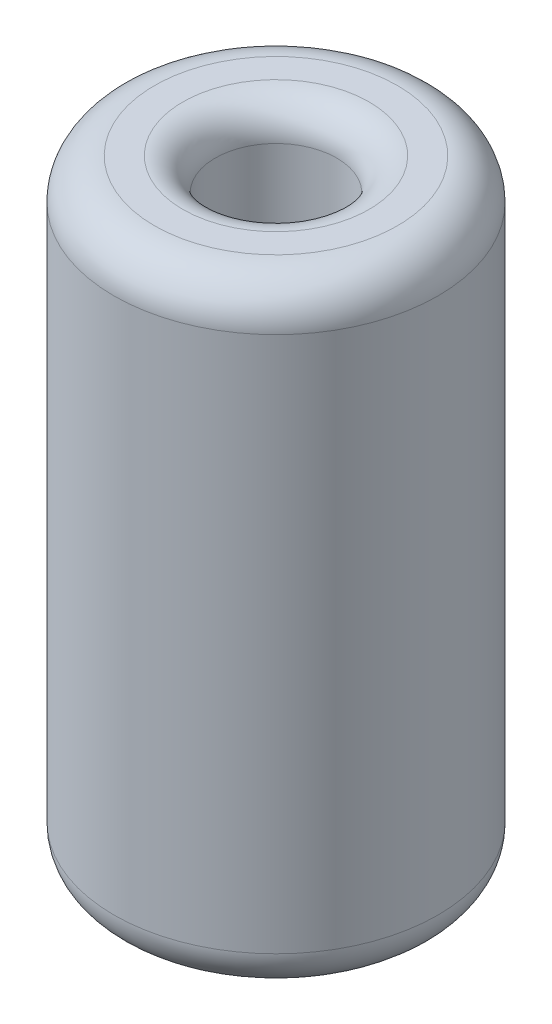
ISO-10303-21;
HEADER;
FILE_DESCRIPTION(('STEP AP214'),'2;1');
FILE_NAME('part.step','',(''),(''),'','','');
FILE_SCHEMA(('AUTOMOTIVE_DESIGN { 1 0 10303 214 1 1 1 1 }'));
ENDSEC;
DATA;
#1=APPLICATION_CONTEXT('core data for automotive mechanical design processes');
#2=APPLICATION_PROTOCOL_DEFINITION('international standard','automotive_design',2000,#1);
#3=PRODUCT_CONTEXT('',#1,'mechanical');
#4=PRODUCT('Part','Part','',(#3));
#5=PRODUCT_RELATED_PRODUCT_CATEGORY('part','',(#4));
#6=PRODUCT_DEFINITION_FORMATION('','',#4);
#7=PRODUCT_DEFINITION_CONTEXT('part definition',#1,'design');
#8=PRODUCT_DEFINITION('design','',#6,#7);
#9=PRODUCT_DEFINITION_SHAPE('','',#8);
#10=(LENGTH_UNIT() NAMED_UNIT(*) SI_UNIT(.MILLI.,.METRE.));
#11=(NAMED_UNIT(*) PLANE_ANGLE_UNIT() SI_UNIT($,.RADIAN.));
#12=(NAMED_UNIT(*) SI_UNIT($,.STERADIAN.) SOLID_ANGLE_UNIT());
#13=UNCERTAINTY_MEASURE_WITH_UNIT(LENGTH_MEASURE(1.E-05),#10,'distance_accuracy_value','');
#14=(GEOMETRIC_REPRESENTATION_CONTEXT(3) GLOBAL_UNCERTAINTY_ASSIGNED_CONTEXT((#13)) GLOBAL_UNIT_ASSIGNED_CONTEXT((#10,
#11,#12)) REPRESENTATION_CONTEXT('',''));
#15=CARTESIAN_POINT('',(0.,0.,0.));
#16=DIRECTION('',(0.,0.,1.));
#17=DIRECTION('',(1.,0.,0.));
#18=AXIS2_PLACEMENT_3D('',#15,#16,#17);
#19=CARTESIAN_POINT('',(0.,0.5,0.));
#20=DIRECTION('',(0.,-1.,0.));
#21=DIRECTION('',(0.,0.,-1.));
#22=AXIS2_PLACEMENT_3D('',#19,#20,#21);
#23=TOROIDAL_SURFACE('',#22,1.5,0.5);
#24=CARTESIAN_POINT('',(0.,0.500000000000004,0.));
#25=DIRECTION('',(0.,-1.,0.));
#26=DIRECTION('',(0.,0.,-1.));
#27=AXIS2_PLACEMENT_3D('',#24,#25,#26);
#28=CIRCLE('',#27,2.);
#29=CARTESIAN_POINT('',(0.,0.500000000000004,-2.));
#30=VERTEX_POINT('',#29);
#31=EDGE_CURVE('E10',#30,#30,#28,.T.);
#32=ORIENTED_EDGE('',*,*,#31,.T.);
#33=EDGE_LOOP('',(#32));
#34=FACE_BOUND('',#33,.T.);
#35=CARTESIAN_POINT('',(0.,0.,0.));
#36=DIRECTION('',(0.,-1.,0.));
#37=DIRECTION('',(0.,0.,-1.));
#38=AXIS2_PLACEMENT_3D('',#35,#36,#37);
#39=CIRCLE('',#38,1.5);
#40=CARTESIAN_POINT('',(0.,0.,-1.5));
#41=VERTEX_POINT('',#40);
#42=EDGE_CURVE('E63',#41,#41,#39,.T.);
#43=ORIENTED_EDGE('',*,*,#42,.F.);
#44=EDGE_LOOP('',(#43));
#45=FACE_BOUND('',#44,.T.);
#46=ADVANCED_FACE('F35',(#34,#45),#23,.T.);
#47=CARTESIAN_POINT('',(0.,0.,0.));
#48=DIRECTION('',(0.,-1.,0.));
#49=DIRECTION('',(0.,0.,-1.));
#50=AXIS2_PLACEMENT_3D('',#47,#48,#49);
#51=CYLINDRICAL_SURFACE('',#50,2.);
#52=CARTESIAN_POINT('',(0.,7.12,0.));
#53=DIRECTION('',(0.,-1.,0.));
#54=DIRECTION('',(0.,0.,-1.));
#55=AXIS2_PLACEMENT_3D('',#52,#53,#54);
#56=CIRCLE('',#55,2.);
#57=CARTESIAN_POINT('',(0.,7.12,-2.));
#58=VERTEX_POINT('',#57);
#59=EDGE_CURVE('E41',#58,#58,#56,.T.);
#60=ORIENTED_EDGE('',*,*,#59,.T.);
#61=EDGE_LOOP('',(#60));
#62=FACE_BOUND('',#61,.T.);
#63=ORIENTED_EDGE('',*,*,#31,.F.);
#64=EDGE_LOOP('',(#63));
#65=FACE_BOUND('',#64,.T.);
#66=ADVANCED_FACE('F71',(#62,#65),#51,.T.);
#67=CARTESIAN_POINT('',(0.,7.12,0.));
#68=DIRECTION('',(0.,-1.,0.));
#69=DIRECTION('',(0.,0.,-1.));
#70=AXIS2_PLACEMENT_3D('',#67,#68,#69);
#71=TOROIDAL_SURFACE('',#70,1.5,0.5);
#72=CARTESIAN_POINT('',(0.,7.62,0.));
#73=DIRECTION('',(0.,-1.,0.));
#74=DIRECTION('',(0.,0.,-1.));
#75=AXIS2_PLACEMENT_3D('',#72,#73,#74);
#76=CIRCLE('',#75,1.5);
#77=CARTESIAN_POINT('',(0.,7.62,-1.5));
#78=VERTEX_POINT('',#77);
#79=EDGE_CURVE('E45',#78,#78,#76,.T.);
#80=ORIENTED_EDGE('',*,*,#79,.T.);
#81=EDGE_LOOP('',(#80));
#82=FACE_BOUND('',#81,.T.);
#83=ORIENTED_EDGE('',*,*,#59,.F.);
#84=EDGE_LOOP('',(#83));
#85=FACE_BOUND('',#84,.T.);
#86=ADVANCED_FACE('F75',(#82,#85),#71,.T.);
#87=CARTESIAN_POINT('',(1.5,7.62,0.));
#88=DIRECTION('',(0.,1.,0.));
#89=DIRECTION('',(0.,0.,1.));
#90=AXIS2_PLACEMENT_3D('',#87,#88,#89);
#91=PLANE('',#90);
#92=CARTESIAN_POINT('',(0.,7.62,0.));
#93=DIRECTION('',(0.,-1.,0.));
#94=DIRECTION('',(0.,0.,-1.));
#95=AXIS2_PLACEMENT_3D('',#92,#93,#94);
#96=CIRCLE('',#95,1.15);
#97=CARTESIAN_POINT('',(0.,7.62,-1.15));
#98=VERTEX_POINT('',#97);
#99=EDGE_CURVE('E49',#98,#98,#96,.T.);
#100=ORIENTED_EDGE('',*,*,#99,.T.);
#101=EDGE_LOOP('',(#100));
#102=FACE_BOUND('',#101,.T.);
#103=ORIENTED_EDGE('',*,*,#79,.F.);
#104=EDGE_LOOP('',(#103));
#105=FACE_BOUND('',#104,.T.);
#106=ADVANCED_FACE('F79',(#102,#105),#91,.T.);
#107=CARTESIAN_POINT('',(0.,7.22,0.));
#108=DIRECTION('',(0.,-1.,0.));
#109=DIRECTION('',(0.,0.,-1.));
#110=AXIS2_PLACEMENT_3D('',#107,#108,#109);
#111=TOROIDAL_SURFACE('',#110,1.15,0.4);
#112=CARTESIAN_POINT('',(0.,7.22,0.));
#113=DIRECTION('',(0.,-1.,0.));
#114=DIRECTION('',(0.,0.,-1.));
#115=AXIS2_PLACEMENT_3D('',#112,#113,#114);
#116=CIRCLE('',#115,0.75);
#117=CARTESIAN_POINT('',(0.,7.22,-0.75));
#118=VERTEX_POINT('',#117);
#119=EDGE_CURVE('E54',#118,#118,#116,.T.);
#120=ORIENTED_EDGE('',*,*,#119,.T.);
#121=EDGE_LOOP('',(#120));
#122=FACE_BOUND('',#121,.T.);
#123=ORIENTED_EDGE('',*,*,#99,.F.);
#124=EDGE_LOOP('',(#123));
#125=FACE_BOUND('',#124,.T.);
#126=ADVANCED_FACE('F86',(#122,#125),#111,.T.);
#127=CARTESIAN_POINT('',(0.,0.,0.));
#128=DIRECTION('',(0.,-1.,0.));
#129=DIRECTION('',(0.,0.,-1.));
#130=AXIS2_PLACEMENT_3D('',#127,#128,#129);
#131=CYLINDRICAL_SURFACE('',#130,0.75);
#132=CARTESIAN_POINT('',(0.,0.4,0.));
#133=DIRECTION('',(0.,-1.,0.));
#134=DIRECTION('',(0.,0.,-1.));
#135=AXIS2_PLACEMENT_3D('',#132,#133,#134);
#136=CIRCLE('',#135,0.750000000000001);
#137=CARTESIAN_POINT('',(0.,0.4,-0.750000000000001));
#138=VERTEX_POINT('',#137);
#139=EDGE_CURVE('E57',#138,#138,#136,.T.);
#140=ORIENTED_EDGE('',*,*,#139,.T.);
#141=EDGE_LOOP('',(#140));
#142=FACE_BOUND('',#141,.T.);
#143=ORIENTED_EDGE('',*,*,#119,.F.);
#144=EDGE_LOOP('',(#143));
#145=FACE_BOUND('',#144,.T.);
#146=ADVANCED_FACE('F90',(#142,#145),#131,.F.);
#147=CARTESIAN_POINT('',(0.,0.4,0.));
#148=DIRECTION('',(0.,-1.,0.));
#149=DIRECTION('',(0.,0.,-1.));
#150=AXIS2_PLACEMENT_3D('',#147,#148,#149);
#151=TOROIDAL_SURFACE('',#150,1.15,0.4);
#152=CARTESIAN_POINT('',(0.,0.,0.));
#153=DIRECTION('',(0.,-1.,0.));
#154=DIRECTION('',(0.,0.,-1.));
#155=AXIS2_PLACEMENT_3D('',#152,#153,#154);
#156=CIRCLE('',#155,1.15);
#157=CARTESIAN_POINT('',(0.,0.,-1.15));
#158=VERTEX_POINT('',#157);
#159=EDGE_CURVE('E60',#158,#158,#156,.T.);
#160=ORIENTED_EDGE('',*,*,#159,.T.);
#161=EDGE_LOOP('',(#160));
#162=FACE_BOUND('',#161,.T.);
#163=ORIENTED_EDGE('',*,*,#139,.F.);
#164=EDGE_LOOP('',(#163));
#165=FACE_BOUND('',#164,.T.);
#166=ADVANCED_FACE('F94',(#162,#165),#151,.T.);
#167=CARTESIAN_POINT('',(1.15,0.,0.));
#168=DIRECTION('',(0.,-1.,0.));
#169=DIRECTION('',(0.,0.,-1.));
#170=AXIS2_PLACEMENT_3D('',#167,#168,#169);
#171=PLANE('',#170);
#172=ORIENTED_EDGE('',*,*,#42,.T.);
#173=EDGE_LOOP('',(#172));
#174=FACE_BOUND('',#173,.T.);
#175=ORIENTED_EDGE('',*,*,#159,.F.);
#176=EDGE_LOOP('',(#175));
#177=FACE_BOUND('',#176,.T.);
#178=ADVANCED_FACE('F67',(#174,#177),#171,.T.);
#179=CLOSED_SHELL('',(#46,#66,#86,#106,#126,#146,#166,#178));
#180=MANIFOLD_SOLID_BREP('B2',#179);
#181=ADVANCED_BREP_SHAPE_REPRESENTATION('',(#18,#180),#14);
#182=SHAPE_DEFINITION_REPRESENTATION(#9,#181);
ENDSEC;
END-ISO-10303-21;
